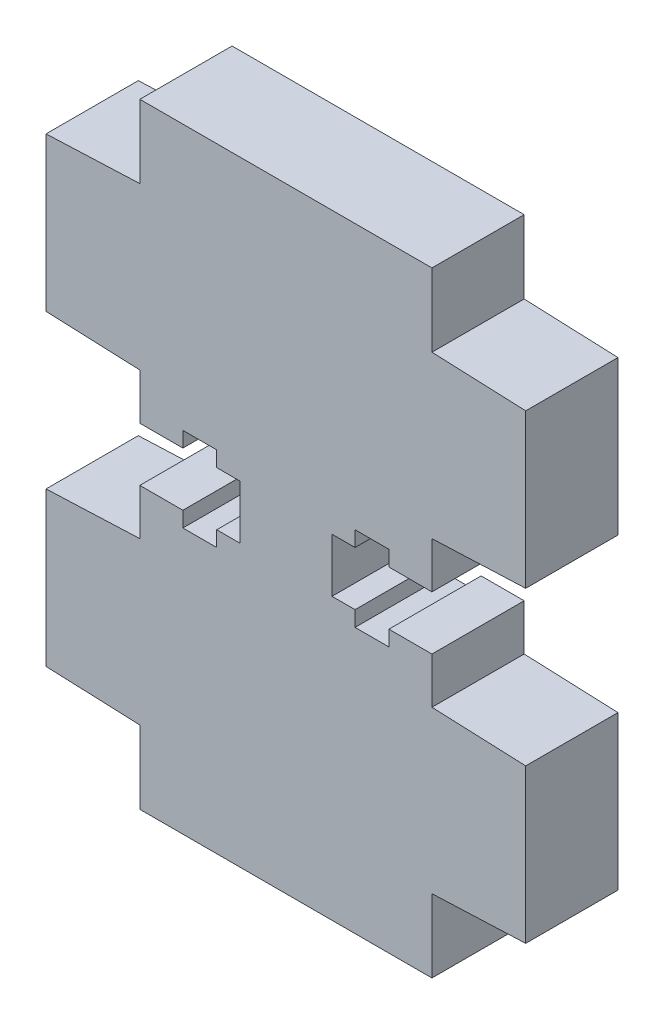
from build123d import *

# Parameters (mm, degrees)
EXTRUDE_1_DEPTH = 6


with BuildPart() as part:
    # Sketch 1 → Extrude 1 (new body)
    with BuildSketch(Plane.XY):
        Polygon((0, 20), (9.5, 20), (9.5, 15.25), (15.6, 15), (15.6, 5), (9.5, 4.75), (9.5, 1.75), (6.7, 1.75), (6.7, 2.75), (4.5, 2.75), (4.5, 1.75), (3, 1.75), (3, 0), (0, 0), align=None)
    extrude(amount=EXTRUDE_1_DEPTH)

    # Mirror 1: part across plane


with BuildPart() as part_1:
    add(part.part)
    add(part.part.mirror(Plane(origin=(0, 20, 6), x_dir=(0, 0, 1), z_dir=(1, 0, 0))))

    # Mirror 2: part across plane


with BuildPart() as part_2:
    add(part_1.part)
    add(part_1.part.mirror(Plane(origin=(0, 0, 6), x_dir=(0, 0, 1), z_dir=(0, 1, 0))))


solid = part_2.part
